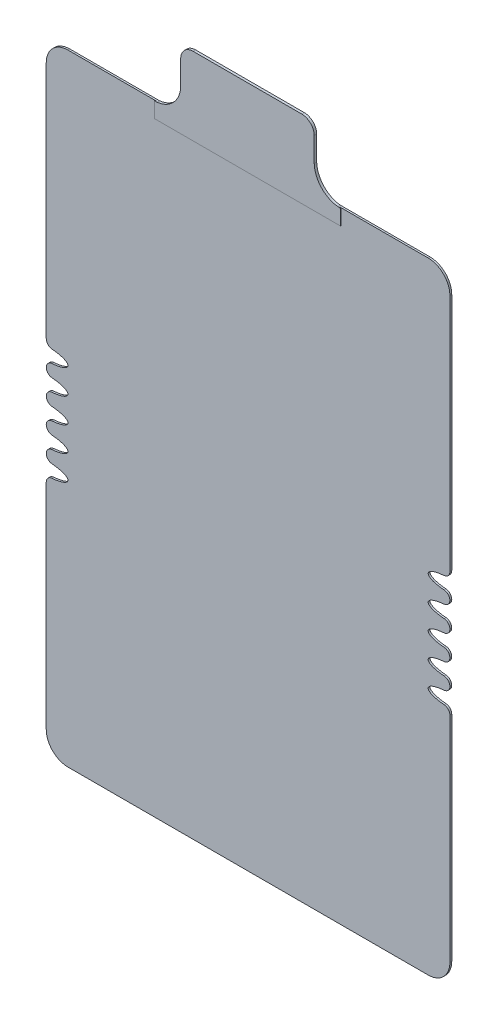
from build123d import *

# Parameters (mm, degrees)
EXTRUDE_1_DEPTH = 0.6
EXTRUDE_2_DEPTH = 0.8


with BuildPart() as part:
    # Sketch 1 → Extrude 1 (new body)
    with BuildSketch(Plane.XY):
        with BuildLine():
            ThreePointArc((63.162295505, -13.978760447), (64.465501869, -13.346350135), (64.99994639, -12))
            ThreePointArc((64.99994639, -12), (64.465501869, -10.653649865), (63.162295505, -10.021239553))
            add(Edge.make_bspline(
                [(63.162295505, -5.978760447), (38.336583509, -8), (63.162295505, -10.021239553)],
                knots=[4.978032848, 4.978032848, 4.978032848, 7.588337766, 7.588337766, 7.588337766], degree=2, weights=[1, 0.262530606, 1]))
            ThreePointArc((63.162295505, -5.978760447), (64.465501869, -5.346350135), (64.99994639, -4))
            ThreePointArc((64.99994639, -4), (64.465501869, -2.653649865), (63.162295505, -2.021239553))
            add(Edge.make_bspline(
                [(63.162295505, 2.021239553), (38.336300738, 0), (63.162295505, -2.021239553)],
                knots=[4.978030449, 4.978030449, 4.978030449, 7.588340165, 7.588340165, 7.588340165], degree=2, weights=[1, 0.262528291, 1]))
            ThreePointArc((63.162295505, 2.021239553), (64.465501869, 2.653649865), (64.99994639, 4))
            ThreePointArc((64.99994639, 4), (64.465501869, 5.346350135), (63.162295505, 5.978760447))
            add(Edge.make_bspline(
                [(63.162295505, 10.021239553), (38.336631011, 8), (63.162295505, 5.978760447)],
                knots=[4.97803309, 4.97803309, 4.97803309, 7.588337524, 7.588337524, 7.588337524], degree=2, weights=[1, 0.26253084, 1]))
            ThreePointArc((63.162295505, 10.021239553), (64.465501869, 10.653649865), (64.99994639, 12))
            ThreePointArc((64.99994639, 12), (64.465501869, 13.346350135), (63.162295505, 13.978760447))
            add(Edge.make_bspline(
                [(63.162295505, 18.021239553), (38.336596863, 16), (63.162295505, 13.978760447)],
                knots=[4.978032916, 4.978032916, 4.978032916, 7.588337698, 7.588337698, 7.588337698], degree=2, weights=[1, 0.262530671, 1]))
            ThreePointArc((63.162295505, 18.021239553), (64.470474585, 18.659024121), (65, 20.01464372))
            Line((65, 20.01464372), (65, 97))
            ThreePointArc((65, 97), (62.949747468, 101.949747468), (58, 104))
            Line((58, 104), (29.079137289, 104))
            ThreePointArc((29.079137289, 104), (29.538890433, 103.962509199), (30, 103.95))
            Line((30, 103.95), (30, 99))
            Line((30, 99), (-30, 99))
            Line((-30, 99), (-30, 103.95))
            ThreePointArc((-30, 103.95), (-29.53868038, 103.962509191), (-29.078716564, 104))
            Line((-29.078716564, 104), (-58, 104))
            ThreePointArc((-58, 104), (-62.949747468, 101.949747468), (-65, 97))
            Line((-65, 97), (-65, 20.01464372))
            ThreePointArc((-65, 20.01464372), (-64.470474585, 18.659024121), (-63.162295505, 18.021239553))
            add(Edge.make_bspline(
                [(-63.162295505, 13.978760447), (-38.33654421, 16), (-63.162295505, 18.021239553)],
                knots=[1.836439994, 1.836439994, 1.836439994, 4.446745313, 4.446745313, 4.446745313], degree=2, weights=[1, 0.262530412, 1]))
            ThreePointArc((-63.162295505, 13.978760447), (-64.465501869, 13.346350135), (-64.99994639, 12))
            ThreePointArc((-64.99994639, 12), (-64.465501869, 10.653649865), (-63.162295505, 10.021239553))
            add(Edge.make_bspline(
                [(-63.162295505, 5.978760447), (-38.336568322, 8), (-63.162295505, 10.021239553)],
                knots=[1.836440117, 1.836440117, 1.836440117, 4.44674519, 4.44674519, 4.44674519], degree=2, weights=[1, 0.262530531, 1]))
            ThreePointArc((-63.162295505, 5.978760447), (-64.465501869, 5.346350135), (-64.99994639, 4))
            ThreePointArc((-64.99994639, 4), (-64.465501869, 2.653649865), (-63.162295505, 2.021239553))
            add(Edge.make_bspline(
                [(-63.162295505, -2.021239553), (-38.336577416, 0), (-63.162295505, 2.021239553)],
                knots=[4.978032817, 4.978032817, 4.978032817, 7.588337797, 7.588337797, 7.588337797], degree=2, weights=[1, 0.262530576, 1]))
            ThreePointArc((-63.162295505, -2.021239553), (-64.465501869, -2.653649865), (-64.99994639, -4))
            ThreePointArc((-64.99994639, -4), (-64.465501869, -5.346350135), (-63.162295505, -5.978760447))
            add(Edge.make_bspline(
                [(-63.162295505, -10.021239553), (-38.33652857, -8), (-63.162295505, -5.978760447)],
                knots=[4.978032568, 4.978032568, 4.978032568, 7.588338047, 7.588338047, 7.588338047], degree=2, weights=[1, 0.262530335, 1]))
            ThreePointArc((-63.162295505, -10.021239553), (-64.465501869, -10.653649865), (-64.99994639, -12))
            ThreePointArc((-64.99994639, -12), (-64.465501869, -13.346350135), (-63.162295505, -13.978760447))
            add(Edge.make_bspline(
                [(-63.162295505, -18.021239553), (-38.336600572, -16), (-63.162295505, -13.978760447)],
                knots=[4.978032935, 4.978032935, 4.978032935, 7.588337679, 7.588337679, 7.588337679], degree=2, weights=[1, 0.26253069, 1]))
            ThreePointArc((-63.162295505, -18.021239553), (-64.470474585, -18.659024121), (-65, -20.01464372))
            Line((-65, -20.01464372), (-65, -89))
            ThreePointArc((-65, -89), (-62.949747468, -93.949747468), (-58, -96))
            Line((-58, -96), (58, -96))
            ThreePointArc((58, -96), (62.949747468, -93.949747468), (65, -89))
            Line((65, -89), (65, -20.01464372))
            ThreePointArc((65, -20.01464372), (64.470474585, -18.659024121), (63.162295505, -18.021239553))
            add(Edge.make_bspline(
                [(63.162295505, -13.978760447), (38.336517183, -16), (63.162295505, -18.021239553)],
                knots=[4.97803251, 4.97803251, 4.97803251, 7.588338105, 7.588338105, 7.588338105], degree=2, weights=[1, 0.262530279, 1]))
        make_face()
    extrude(amount=EXTRUDE_1_DEPTH)

    # Sketch 1_3 → Extrude 2 (add)
    with BuildSketch(Plane.XY):
        with BuildLine():
            Line((-17.5, 124), (17.5, 124))
            ThreePointArc((17.5, 124), (20.328427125, 122.828427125), (21.5, 120))
            Line((21.5, 120), (21.5, 112.166773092))
            ThreePointArc((21.5, 112.166773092), (24.08887997, 106.340008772), (30, 103.95))
            Line((30, 103.95), (30, 99))
            Line((30, 99), (-30, 99))
            Line((-30, 99), (-30, 103.95))
            ThreePointArc((-30, 103.95), (-24.146851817, 106.281567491), (-21.5, 111.99906048))
            Line((-21.5, 111.99906048), (-21.5, 120))
            ThreePointArc((-21.5, 120), (-20.328427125, 122.828427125), (-17.5, 124))
        make_face()
    extrude(amount=EXTRUDE_2_DEPTH)


solid = part.part
